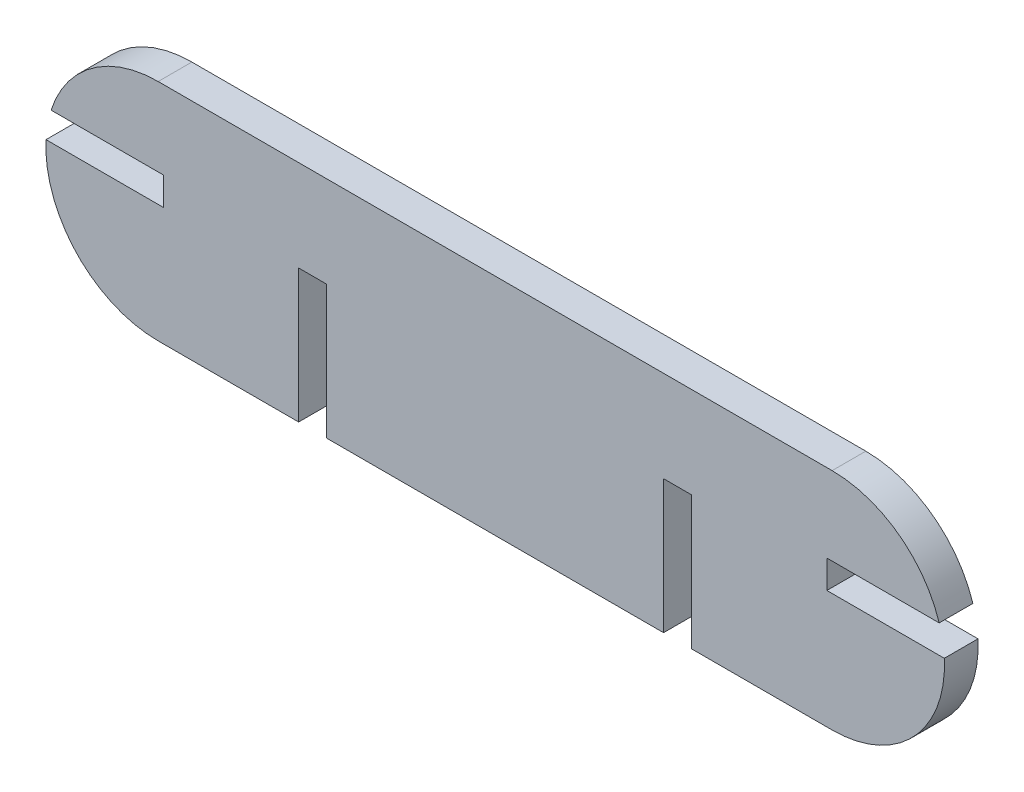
ISO-10303-21;
HEADER;
FILE_DESCRIPTION(('STEP AP214'),'2;1');
FILE_NAME('part.step','',(''),(''),'','','');
FILE_SCHEMA(('AUTOMOTIVE_DESIGN { 1 0 10303 214 1 1 1 1 }'));
ENDSEC;
DATA;
#1=APPLICATION_CONTEXT('core data for automotive mechanical design processes');
#2=APPLICATION_PROTOCOL_DEFINITION('international standard','automotive_design',2000,#1);
#3=PRODUCT_CONTEXT('',#1,'mechanical');
#4=PRODUCT('Part','Part','',(#3));
#5=PRODUCT_RELATED_PRODUCT_CATEGORY('part','',(#4));
#6=PRODUCT_DEFINITION_FORMATION('','',#4);
#7=PRODUCT_DEFINITION_CONTEXT('part definition',#1,'design');
#8=PRODUCT_DEFINITION('design','',#6,#7);
#9=PRODUCT_DEFINITION_SHAPE('','',#8);
#10=(LENGTH_UNIT() NAMED_UNIT(*) SI_UNIT(.MILLI.,.METRE.));
#11=(NAMED_UNIT(*) PLANE_ANGLE_UNIT() SI_UNIT($,.RADIAN.));
#12=(NAMED_UNIT(*) SI_UNIT($,.STERADIAN.) SOLID_ANGLE_UNIT());
#13=UNCERTAINTY_MEASURE_WITH_UNIT(LENGTH_MEASURE(1.E-05),#10,'distance_accuracy_value','');
#14=(GEOMETRIC_REPRESENTATION_CONTEXT(3) GLOBAL_UNCERTAINTY_ASSIGNED_CONTEXT((#13)) GLOBAL_UNIT_ASSIGNED_CONTEXT((#10,
#11,#12)) REPRESENTATION_CONTEXT('',''));
#15=CARTESIAN_POINT('',(0.,0.,0.));
#16=DIRECTION('',(0.,0.,1.));
#17=DIRECTION('',(1.,0.,0.));
#18=AXIS2_PLACEMENT_3D('',#15,#16,#17);
#19=CARTESIAN_POINT('',(30.0000000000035,-1.77500000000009,3.));
#20=DIRECTION('',(0.,0.,-1.));
#21=DIRECTION('',(-1.,0.,0.));
#22=AXIS2_PLACEMENT_3D('',#19,#20,#21);
#23=CYLINDRICAL_SURFACE('',#22,10.);
#24=CARTESIAN_POINT('',(30.0000000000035,-1.77500000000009,0.));
#25=DIRECTION('',(0.,0.,1.));
#26=DIRECTION('',(1.,0.,0.));
#27=AXIS2_PLACEMENT_3D('',#24,#25,#26);
#28=CIRCLE('',#27,10.);
#29=CARTESIAN_POINT('',(30.0000000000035,-11.7750000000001,0.));
#30=VERTEX_POINT('',#29);
#31=CARTESIAN_POINT('',(39.9862092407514,-1.25,0.));
#32=VERTEX_POINT('',#31);
#33=EDGE_CURVE('E201',#30,#32,#28,.T.);
#34=ORIENTED_EDGE('',*,*,#33,.T.);
#35=DIRECTION('',(0.,0.,-1.));
#36=VECTOR('',#35,1.);
#37=CARTESIAN_POINT('',(39.9862092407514,-1.25,3.));
#38=LINE('',#37,#36);
#39=CARTESIAN_POINT('',(39.9862092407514,-1.25,3.));
#40=VERTEX_POINT('',#39);
#41=EDGE_CURVE('E11',#40,#32,#38,.T.);
#42=ORIENTED_EDGE('',*,*,#41,.F.);
#43=CARTESIAN_POINT('',(30.0000000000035,-1.77500000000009,3.));
#44=DIRECTION('',(0.,0.,1.));
#45=DIRECTION('',(1.,0.,0.));
#46=AXIS2_PLACEMENT_3D('',#43,#44,#45);
#47=CIRCLE('',#46,10.);
#48=CARTESIAN_POINT('',(30.0000000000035,-11.7750000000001,3.));
#49=VERTEX_POINT('',#48);
#50=EDGE_CURVE('E239',#49,#40,#47,.T.);
#51=ORIENTED_EDGE('',*,*,#50,.F.);
#52=DIRECTION('',(0.,0.,-1.));
#53=VECTOR('',#52,1.);
#54=CARTESIAN_POINT('',(30.0000000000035,-11.7750000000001,3.));
#55=LINE('',#54,#53);
#56=EDGE_CURVE('E197',#49,#30,#55,.T.);
#57=ORIENTED_EDGE('',*,*,#56,.T.);
#58=EDGE_LOOP('',(#34,#42,#51,#57));
#59=FACE_BOUND('',#58,.T.);
#60=ADVANCED_FACE('F33',(#59),#23,.T.);
#61=CARTESIAN_POINT('',(39.9862092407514,-1.25,3.));
#62=DIRECTION('',(0.,-1.,0.));
#63=DIRECTION('',(0.,0.,-1.));
#64=AXIS2_PLACEMENT_3D('',#61,#62,#63);
#65=PLANE('',#64);
#66=DIRECTION('',(-1.,0.,0.));
#67=VECTOR('',#66,1.);
#68=CARTESIAN_POINT('',(39.9862092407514,-1.25,0.));
#69=LINE('',#68,#67);
#70=CARTESIAN_POINT('',(29.5314938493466,-1.25,0.));
#71=VERTEX_POINT('',#70);
#72=EDGE_CURVE('E204',#32,#71,#69,.T.);
#73=ORIENTED_EDGE('',*,*,#72,.T.);
#74=DIRECTION('',(0.,0.,-1.));
#75=VECTOR('',#74,1.);
#76=CARTESIAN_POINT('',(29.5314938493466,-1.25,3.));
#77=LINE('',#76,#75);
#78=CARTESIAN_POINT('',(29.5314938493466,-1.25,3.));
#79=VERTEX_POINT('',#78);
#80=EDGE_CURVE('E41',#79,#71,#77,.T.);
#81=ORIENTED_EDGE('',*,*,#80,.F.);
#82=DIRECTION('',(-1.,0.,0.));
#83=VECTOR('',#82,1.);
#84=CARTESIAN_POINT('',(39.9862092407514,-1.25,3.));
#85=LINE('',#84,#83);
#86=EDGE_CURVE('E128',#40,#79,#85,.T.);
#87=ORIENTED_EDGE('',*,*,#86,.F.);
#88=ORIENTED_EDGE('',*,*,#41,.T.);
#89=EDGE_LOOP('',(#73,#81,#87,#88));
#90=FACE_BOUND('',#89,.T.);
#91=ADVANCED_FACE('F357',(#90),#65,.F.);
#92=CARTESIAN_POINT('',(29.5314938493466,1.25,3.));
#93=DIRECTION('',(-1.,0.,0.));
#94=DIRECTION('',(0.,0.,1.));
#95=AXIS2_PLACEMENT_3D('',#92,#93,#94);
#96=PLANE('',#95);
#97=DIRECTION('',(0.,1.,0.));
#98=VECTOR('',#97,1.);
#99=CARTESIAN_POINT('',(29.5314938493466,1.25,0.));
#100=LINE('',#99,#98);
#101=CARTESIAN_POINT('',(29.5314938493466,1.25,0.));
#102=VERTEX_POINT('',#101);
#103=EDGE_CURVE('E206',#71,#102,#100,.T.);
#104=ORIENTED_EDGE('',*,*,#103,.T.);
#105=DIRECTION('',(0.,0.,-1.));
#106=VECTOR('',#105,1.);
#107=CARTESIAN_POINT('',(29.5314938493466,1.25,3.));
#108=LINE('',#107,#106);
#109=CARTESIAN_POINT('',(29.5314938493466,1.25,3.));
#110=VERTEX_POINT('',#109);
#111=EDGE_CURVE('E282',#110,#102,#108,.T.);
#112=ORIENTED_EDGE('',*,*,#111,.F.);
#113=DIRECTION('',(0.,1.,0.));
#114=VECTOR('',#113,1.);
#115=CARTESIAN_POINT('',(29.5314938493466,1.25,3.));
#116=LINE('',#115,#114);
#117=EDGE_CURVE('E290',#79,#110,#116,.T.);
#118=ORIENTED_EDGE('',*,*,#117,.F.);
#119=ORIENTED_EDGE('',*,*,#80,.T.);
#120=EDGE_LOOP('',(#104,#112,#118,#119));
#121=FACE_BOUND('',#120,.T.);
#122=ADVANCED_FACE('F288',(#121),#96,.F.);
#123=CARTESIAN_POINT('',(39.5314938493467,1.25,3.));
#124=DIRECTION('',(0.,1.,0.));
#125=DIRECTION('',(0.,0.,1.));
#126=AXIS2_PLACEMENT_3D('',#123,#124,#125);
#127=PLANE('',#126);
#128=DIRECTION('',(1.,0.,0.));
#129=VECTOR('',#128,1.);
#130=CARTESIAN_POINT('',(39.5314938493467,1.25,0.));
#131=LINE('',#130,#129);
#132=CARTESIAN_POINT('',(39.5314938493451,1.24999999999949,0.));
#133=VERTEX_POINT('',#132);
#134=EDGE_CURVE('E208',#102,#133,#131,.T.);
#135=ORIENTED_EDGE('',*,*,#134,.T.);
#136=DIRECTION('',(0.,0.,-1.));
#137=VECTOR('',#136,1.);
#138=CARTESIAN_POINT('',(39.5314938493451,1.24999999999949,3.));
#139=LINE('',#138,#137);
#140=CARTESIAN_POINT('',(39.5314938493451,1.24999999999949,3.));
#141=VERTEX_POINT('',#140);
#142=EDGE_CURVE('E279',#141,#133,#139,.T.);
#143=ORIENTED_EDGE('',*,*,#142,.F.);
#144=DIRECTION('',(1.,0.,0.));
#145=VECTOR('',#144,1.);
#146=CARTESIAN_POINT('',(39.5314938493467,1.25,3.));
#147=LINE('',#146,#145);
#148=EDGE_CURVE('E308',#110,#141,#147,.T.);
#149=ORIENTED_EDGE('',*,*,#148,.F.);
#150=ORIENTED_EDGE('',*,*,#111,.T.);
#151=EDGE_LOOP('',(#135,#143,#149,#150));
#152=FACE_BOUND('',#151,.T.);
#153=ADVANCED_FACE('F299',(#152),#127,.F.);
#154=CARTESIAN_POINT('',(30.0000000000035,-1.77500000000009,3.));
#155=DIRECTION('',(0.,0.,-1.));
#156=DIRECTION('',(-1.,0.,0.));
#157=AXIS2_PLACEMENT_3D('',#154,#155,#156);
#158=CYLINDRICAL_SURFACE('',#157,10.0000000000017);
#159=CARTESIAN_POINT('',(30.0000000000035,-1.77500000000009,0.));
#160=DIRECTION('',(0.,0.,1.));
#161=DIRECTION('',(1.,0.,0.));
#162=AXIS2_PLACEMENT_3D('',#159,#160,#161);
#163=CIRCLE('',#162,10.0000000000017);
#164=CARTESIAN_POINT('',(30.0000000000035,8.22499999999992,0.));
#165=VERTEX_POINT('',#164);
#166=EDGE_CURVE('E210',#133,#165,#163,.T.);
#167=ORIENTED_EDGE('',*,*,#166,.T.);
#168=DIRECTION('',(0.,0.,-1.));
#169=VECTOR('',#168,1.);
#170=CARTESIAN_POINT('',(30.0000000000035,8.22499999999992,3.));
#171=LINE('',#170,#169);
#172=CARTESIAN_POINT('',(30.0000000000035,8.22499999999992,3.));
#173=VERTEX_POINT('',#172);
#174=EDGE_CURVE('E276',#173,#165,#171,.T.);
#175=ORIENTED_EDGE('',*,*,#174,.F.);
#176=CARTESIAN_POINT('',(30.0000000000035,-1.77500000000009,3.));
#177=DIRECTION('',(0.,0.,1.));
#178=DIRECTION('',(1.,0.,0.));
#179=AXIS2_PLACEMENT_3D('',#176,#177,#178);
#180=CIRCLE('',#179,10.0000000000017);
#181=EDGE_CURVE('E305',#141,#173,#180,.T.);
#182=ORIENTED_EDGE('',*,*,#181,.F.);
#183=ORIENTED_EDGE('',*,*,#142,.T.);
#184=EDGE_LOOP('',(#167,#175,#182,#183));
#185=FACE_BOUND('',#184,.T.);
#186=ADVANCED_FACE('F303',(#185),#158,.T.);
#187=CARTESIAN_POINT('',(-29.9999999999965,8.22499999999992,3.));
#188=DIRECTION('',(0.,-1.,0.));
#189=DIRECTION('',(0.,0.,-1.));
#190=AXIS2_PLACEMENT_3D('',#187,#188,#189);
#191=PLANE('',#190);
#192=DIRECTION('',(-1.,0.,0.));
#193=VECTOR('',#192,1.);
#194=CARTESIAN_POINT('',(-29.9999999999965,8.22499999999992,0.));
#195=LINE('',#194,#193);
#196=CARTESIAN_POINT('',(-29.9999999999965,8.22500000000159,0.));
#197=VERTEX_POINT('',#196);
#198=EDGE_CURVE('E212',#165,#197,#195,.T.);
#199=ORIENTED_EDGE('',*,*,#198,.T.);
#200=DIRECTION('',(0.,0.,-1.));
#201=VECTOR('',#200,1.);
#202=CARTESIAN_POINT('',(-29.9999999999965,8.22500000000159,3.));
#203=LINE('',#202,#201);
#204=CARTESIAN_POINT('',(-29.9999999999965,8.22500000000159,3.));
#205=VERTEX_POINT('',#204);
#206=EDGE_CURVE('E273',#205,#197,#203,.T.);
#207=ORIENTED_EDGE('',*,*,#206,.F.);
#208=DIRECTION('',(-1.,0.,0.));
#209=VECTOR('',#208,1.);
#210=CARTESIAN_POINT('',(-29.9999999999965,8.22499999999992,3.));
#211=LINE('',#210,#209);
#212=EDGE_CURVE('E307',#173,#205,#211,.T.);
#213=ORIENTED_EDGE('',*,*,#212,.F.);
#214=ORIENTED_EDGE('',*,*,#174,.T.);
#215=EDGE_LOOP('',(#199,#207,#213,#214));
#216=FACE_BOUND('',#215,.T.);
#217=ADVANCED_FACE('F370',(#216),#191,.F.);
#218=CARTESIAN_POINT('',(-29.9999999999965,-1.77500000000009,3.));
#219=DIRECTION('',(0.,0.,-1.));
#220=DIRECTION('',(-1.,0.,0.));
#221=AXIS2_PLACEMENT_3D('',#218,#219,#220);
#222=CYLINDRICAL_SURFACE('',#221,10.0000000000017);
#223=CARTESIAN_POINT('',(-29.9999999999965,-1.77500000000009,0.));
#224=DIRECTION('',(0.,0.,1.));
#225=DIRECTION('',(1.,0.,0.));
#226=AXIS2_PLACEMENT_3D('',#223,#224,#225);
#227=CIRCLE('',#226,10.0000000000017);
#228=CARTESIAN_POINT('',(-39.5314938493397,1.25,0.));
#229=VERTEX_POINT('',#228);
#230=EDGE_CURVE('E214',#197,#229,#227,.T.);
#231=ORIENTED_EDGE('',*,*,#230,.T.);
#232=DIRECTION('',(0.,0.,-1.));
#233=VECTOR('',#232,1.);
#234=CARTESIAN_POINT('',(-39.5314938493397,1.25,3.));
#235=LINE('',#234,#233);
#236=CARTESIAN_POINT('',(-39.5314938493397,1.25,3.));
#237=VERTEX_POINT('',#236);
#238=EDGE_CURVE('E270',#237,#229,#235,.T.);
#239=ORIENTED_EDGE('',*,*,#238,.F.);
#240=CARTESIAN_POINT('',(-29.9999999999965,-1.77500000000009,3.));
#241=DIRECTION('',(0.,0.,1.));
#242=DIRECTION('',(1.,0.,0.));
#243=AXIS2_PLACEMENT_3D('',#240,#241,#242);
#244=CIRCLE('',#243,10.0000000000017);
#245=EDGE_CURVE('E310',#205,#237,#244,.T.);
#246=ORIENTED_EDGE('',*,*,#245,.F.);
#247=ORIENTED_EDGE('',*,*,#206,.T.);
#248=EDGE_LOOP('',(#231,#239,#246,#247));
#249=FACE_BOUND('',#248,.T.);
#250=ADVANCED_FACE('F373',(#249),#222,.T.);
#251=CARTESIAN_POINT('',(-39.5314938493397,1.25,3.));
#252=DIRECTION('',(0.,1.,0.));
#253=DIRECTION('',(0.,0.,1.));
#254=AXIS2_PLACEMENT_3D('',#251,#252,#253);
#255=PLANE('',#254);
#256=DIRECTION('',(1.,0.,0.));
#257=VECTOR('',#256,1.);
#258=CARTESIAN_POINT('',(-39.5314938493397,1.25,0.));
#259=LINE('',#258,#257);
#260=CARTESIAN_POINT('',(-29.5314938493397,1.25,0.));
#261=VERTEX_POINT('',#260);
#262=EDGE_CURVE('E216',#229,#261,#259,.T.);
#263=ORIENTED_EDGE('',*,*,#262,.T.);
#264=DIRECTION('',(0.,0.,-1.));
#265=VECTOR('',#264,1.);
#266=CARTESIAN_POINT('',(-29.5314938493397,1.25,3.));
#267=LINE('',#266,#265);
#268=CARTESIAN_POINT('',(-29.5314938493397,1.25,3.));
#269=VERTEX_POINT('',#268);
#270=EDGE_CURVE('E267',#269,#261,#267,.T.);
#271=ORIENTED_EDGE('',*,*,#270,.F.);
#272=DIRECTION('',(1.,0.,0.));
#273=VECTOR('',#272,1.);
#274=CARTESIAN_POINT('',(-39.5314938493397,1.25,3.));
#275=LINE('',#274,#273);
#276=EDGE_CURVE('E316',#237,#269,#275,.T.);
#277=ORIENTED_EDGE('',*,*,#276,.F.);
#278=ORIENTED_EDGE('',*,*,#238,.T.);
#279=EDGE_LOOP('',(#263,#271,#277,#278));
#280=FACE_BOUND('',#279,.T.);
#281=ADVANCED_FACE('F377',(#280),#255,.F.);
#282=CARTESIAN_POINT('',(-29.5314938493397,1.25,3.));
#283=DIRECTION('',(1.,0.,0.));
#284=DIRECTION('',(0.,0.,-1.));
#285=AXIS2_PLACEMENT_3D('',#282,#283,#284);
#286=PLANE('',#285);
#287=DIRECTION('',(0.,-1.,0.));
#288=VECTOR('',#287,1.);
#289=CARTESIAN_POINT('',(-29.5314938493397,1.25,0.));
#290=LINE('',#289,#288);
#291=CARTESIAN_POINT('',(-29.5314938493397,-1.25,0.));
#292=VERTEX_POINT('',#291);
#293=EDGE_CURVE('E218',#261,#292,#290,.T.);
#294=ORIENTED_EDGE('',*,*,#293,.T.);
#295=DIRECTION('',(0.,0.,-1.));
#296=VECTOR('',#295,1.);
#297=CARTESIAN_POINT('',(-29.5314938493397,-1.25,3.));
#298=LINE('',#297,#296);
#299=CARTESIAN_POINT('',(-29.5314938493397,-1.25,3.));
#300=VERTEX_POINT('',#299);
#301=EDGE_CURVE('E264',#300,#292,#298,.T.);
#302=ORIENTED_EDGE('',*,*,#301,.F.);
#303=DIRECTION('',(0.,-1.,0.));
#304=VECTOR('',#303,1.);
#305=CARTESIAN_POINT('',(-29.5314938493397,1.25,3.));
#306=LINE('',#305,#304);
#307=EDGE_CURVE('E318',#269,#300,#306,.T.);
#308=ORIENTED_EDGE('',*,*,#307,.F.);
#309=ORIENTED_EDGE('',*,*,#270,.T.);
#310=EDGE_LOOP('',(#294,#302,#308,#309));
#311=FACE_BOUND('',#310,.T.);
#312=ADVANCED_FACE('F381',(#311),#286,.F.);
#313=CARTESIAN_POINT('',(-39.9862092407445,-1.25,3.));
#314=DIRECTION('',(0.,-1.,0.));
#315=DIRECTION('',(0.,0.,-1.));
#316=AXIS2_PLACEMENT_3D('',#313,#314,#315);
#317=PLANE('',#316);
#318=DIRECTION('',(-1.,0.,0.));
#319=VECTOR('',#318,1.);
#320=CARTESIAN_POINT('',(-39.9862092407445,-1.25,0.));
#321=LINE('',#320,#319);
#322=CARTESIAN_POINT('',(-39.9862092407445,-1.25,0.));
#323=VERTEX_POINT('',#322);
#324=EDGE_CURVE('E220',#292,#323,#321,.T.);
#325=ORIENTED_EDGE('',*,*,#324,.T.);
#326=DIRECTION('',(0.,0.,-1.));
#327=VECTOR('',#326,1.);
#328=CARTESIAN_POINT('',(-39.9862092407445,-1.25,3.));
#329=LINE('',#328,#327);
#330=CARTESIAN_POINT('',(-39.9862092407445,-1.25,3.));
#331=VERTEX_POINT('',#330);
#332=EDGE_CURVE('E261',#331,#323,#329,.T.);
#333=ORIENTED_EDGE('',*,*,#332,.F.);
#334=DIRECTION('',(-1.,0.,0.));
#335=VECTOR('',#334,1.);
#336=CARTESIAN_POINT('',(-39.9862092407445,-1.25,3.));
#337=LINE('',#336,#335);
#338=EDGE_CURVE('E320',#300,#331,#337,.T.);
#339=ORIENTED_EDGE('',*,*,#338,.F.);
#340=ORIENTED_EDGE('',*,*,#301,.T.);
#341=EDGE_LOOP('',(#325,#333,#339,#340));
#342=FACE_BOUND('',#341,.T.);
#343=ADVANCED_FACE('F385',(#342),#317,.F.);
#344=CARTESIAN_POINT('',(-29.9999999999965,-1.77500000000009,3.));
#345=DIRECTION('',(0.,0.,-1.));
#346=DIRECTION('',(-1.,0.,0.));
#347=AXIS2_PLACEMENT_3D('',#344,#345,#346);
#348=CYLINDRICAL_SURFACE('',#347,10.);
#349=CARTESIAN_POINT('',(-29.9999999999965,-1.77500000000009,0.));
#350=DIRECTION('',(0.,0.,1.));
#351=DIRECTION('',(1.,0.,0.));
#352=AXIS2_PLACEMENT_3D('',#349,#350,#351);
#353=CIRCLE('',#352,10.);
#354=CARTESIAN_POINT('',(-29.9999999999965,-11.7750000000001,0.));
#355=VERTEX_POINT('',#354);
#356=EDGE_CURVE('E222',#323,#355,#353,.T.);
#357=ORIENTED_EDGE('',*,*,#356,.T.);
#358=DIRECTION('',(0.,0.,-1.));
#359=VECTOR('',#358,1.);
#360=CARTESIAN_POINT('',(-29.9999999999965,-11.7750000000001,3.));
#361=LINE('',#360,#359);
#362=CARTESIAN_POINT('',(-29.9999999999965,-11.7750000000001,3.));
#363=VERTEX_POINT('',#362);
#364=EDGE_CURVE('E258',#363,#355,#361,.T.);
#365=ORIENTED_EDGE('',*,*,#364,.F.);
#366=CARTESIAN_POINT('',(-29.9999999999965,-1.77500000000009,3.));
#367=DIRECTION('',(0.,0.,1.));
#368=DIRECTION('',(1.,0.,0.));
#369=AXIS2_PLACEMENT_3D('',#366,#367,#368);
#370=CIRCLE('',#369,10.);
#371=EDGE_CURVE('E322',#331,#363,#370,.T.);
#372=ORIENTED_EDGE('',*,*,#371,.F.);
#373=ORIENTED_EDGE('',*,*,#332,.T.);
#374=EDGE_LOOP('',(#357,#365,#372,#373));
#375=FACE_BOUND('',#374,.T.);
#376=ADVANCED_FACE('F389',(#375),#348,.T.);
#377=CARTESIAN_POINT('',(-29.9999999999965,-11.7750000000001,3.));
#378=DIRECTION('',(0.,1.,0.));
#379=DIRECTION('',(0.,0.,1.));
#380=AXIS2_PLACEMENT_3D('',#377,#378,#379);
#381=PLANE('',#380);
#382=DIRECTION('',(1.,0.,0.));
#383=VECTOR('',#382,1.);
#384=CARTESIAN_POINT('',(-29.9999999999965,-11.7750000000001,0.));
#385=LINE('',#384,#383);
#386=CARTESIAN_POINT('',(-17.4936420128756,-11.7750000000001,0.));
#387=VERTEX_POINT('',#386);
#388=EDGE_CURVE('E224',#355,#387,#385,.T.);
#389=ORIENTED_EDGE('',*,*,#388,.T.);
#390=DIRECTION('',(0.,0.,-1.));
#391=VECTOR('',#390,1.);
#392=CARTESIAN_POINT('',(-17.4936420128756,-11.7750000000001,3.));
#393=LINE('',#392,#391);
#394=CARTESIAN_POINT('',(-17.4936420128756,-11.7750000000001,3.));
#395=VERTEX_POINT('',#394);
#396=EDGE_CURVE('E255',#395,#387,#393,.T.);
#397=ORIENTED_EDGE('',*,*,#396,.F.);
#398=DIRECTION('',(1.,0.,0.));
#399=VECTOR('',#398,1.);
#400=CARTESIAN_POINT('',(-29.9999999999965,-11.7750000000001,3.));
#401=LINE('',#400,#399);
#402=EDGE_CURVE('E324',#363,#395,#401,.T.);
#403=ORIENTED_EDGE('',*,*,#402,.F.);
#404=ORIENTED_EDGE('',*,*,#364,.T.);
#405=EDGE_LOOP('',(#389,#397,#403,#404));
#406=FACE_BOUND('',#405,.T.);
#407=ADVANCED_FACE('F393',(#406),#381,.F.);
#408=CARTESIAN_POINT('',(-17.4936420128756,0.099999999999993,3.));
#409=DIRECTION('',(-1.,0.,0.));
#410=DIRECTION('',(0.,0.,1.));
#411=AXIS2_PLACEMENT_3D('',#408,#409,#410);
#412=PLANE('',#411);
#413=DIRECTION('',(0.,1.,0.));
#414=VECTOR('',#413,1.);
#415=CARTESIAN_POINT('',(-17.4936420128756,0.099999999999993,0.));
#416=LINE('',#415,#414);
#417=CARTESIAN_POINT('',(-17.4936420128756,0.099999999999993,0.));
#418=VERTEX_POINT('',#417);
#419=EDGE_CURVE('E226',#387,#418,#416,.T.);
#420=ORIENTED_EDGE('',*,*,#419,.T.);
#421=DIRECTION('',(0.,0.,-1.));
#422=VECTOR('',#421,1.);
#423=CARTESIAN_POINT('',(-17.4936420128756,0.099999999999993,3.));
#424=LINE('',#423,#422);
#425=CARTESIAN_POINT('',(-17.4936420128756,0.099999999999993,3.));
#426=VERTEX_POINT('',#425);
#427=EDGE_CURVE('E252',#426,#418,#424,.T.);
#428=ORIENTED_EDGE('',*,*,#427,.F.);
#429=DIRECTION('',(0.,1.,0.));
#430=VECTOR('',#429,1.);
#431=CARTESIAN_POINT('',(-17.4936420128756,0.099999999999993,3.));
#432=LINE('',#431,#430);
#433=EDGE_CURVE('E326',#395,#426,#432,.T.);
#434=ORIENTED_EDGE('',*,*,#433,.F.);
#435=ORIENTED_EDGE('',*,*,#396,.T.);
#436=EDGE_LOOP('',(#420,#428,#434,#435));
#437=FACE_BOUND('',#436,.T.);
#438=ADVANCED_FACE('F397',(#437),#412,.F.);
#439=CARTESIAN_POINT('',(-14.9936420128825,0.0999999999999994,3.));
#440=DIRECTION('',(0.,1.,0.));
#441=DIRECTION('',(-1.,0.,0.));
#442=AXIS2_PLACEMENT_3D('',#439,#440,#441);
#443=PLANE('',#442);
#444=DIRECTION('',(1.,0.,0.));
#445=VECTOR('',#444,1.);
#446=CARTESIAN_POINT('',(-14.9936420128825,0.0999999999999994,0.));
#447=LINE('',#446,#445);
#448=CARTESIAN_POINT('',(-14.9936420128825,0.0999999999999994,0.));
#449=VERTEX_POINT('',#448);
#450=EDGE_CURVE('E228',#418,#449,#447,.T.);
#451=ORIENTED_EDGE('',*,*,#450,.T.);
#452=DIRECTION('',(0.,0.,-1.));
#453=VECTOR('',#452,1.);
#454=CARTESIAN_POINT('',(-14.9936420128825,0.0999999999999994,3.));
#455=LINE('',#454,#453);
#456=CARTESIAN_POINT('',(-14.9936420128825,0.0999999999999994,3.));
#457=VERTEX_POINT('',#456);
#458=EDGE_CURVE('E249',#457,#449,#455,.T.);
#459=ORIENTED_EDGE('',*,*,#458,.F.);
#460=DIRECTION('',(1.,0.,0.));
#461=VECTOR('',#460,1.);
#462=CARTESIAN_POINT('',(-14.9936420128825,0.0999999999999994,3.));
#463=LINE('',#462,#461);
#464=EDGE_CURVE('E328',#426,#457,#463,.T.);
#465=ORIENTED_EDGE('',*,*,#464,.F.);
#466=ORIENTED_EDGE('',*,*,#427,.T.);
#467=EDGE_LOOP('',(#451,#459,#465,#466));
#468=FACE_BOUND('',#467,.T.);
#469=ADVANCED_FACE('F401',(#468),#443,.F.);
#470=CARTESIAN_POINT('',(-14.9936420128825,0.0999999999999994,3.));
#471=DIRECTION('',(1.,5.88272121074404E-13,0.));
#472=DIRECTION('',(-5.88272121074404E-13,1.,0.));
#473=AXIS2_PLACEMENT_3D('',#470,#471,#472);
#474=PLANE('',#473);
#475=DIRECTION('',(5.88272121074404E-13,-1.,0.));
#476=VECTOR('',#475,1.);
#477=CARTESIAN_POINT('',(-14.9936420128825,0.0999999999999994,0.));
#478=LINE('',#477,#476);
#479=CARTESIAN_POINT('',(-14.9936420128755,-11.7750000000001,0.));
#480=VERTEX_POINT('',#479);
#481=EDGE_CURVE('E230',#449,#480,#478,.T.);
#482=ORIENTED_EDGE('',*,*,#481,.T.);
#483=DIRECTION('',(0.,0.,-1.));
#484=VECTOR('',#483,1.);
#485=CARTESIAN_POINT('',(-14.9936420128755,-11.7750000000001,3.));
#486=LINE('',#485,#484);
#487=CARTESIAN_POINT('',(-14.9936420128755,-11.7750000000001,3.));
#488=VERTEX_POINT('',#487);
#489=EDGE_CURVE('E246',#488,#480,#486,.T.);
#490=ORIENTED_EDGE('',*,*,#489,.F.);
#491=DIRECTION('',(5.88272121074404E-13,-1.,0.));
#492=VECTOR('',#491,1.);
#493=CARTESIAN_POINT('',(-14.9936420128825,0.0999999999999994,3.));
#494=LINE('',#493,#492);
#495=EDGE_CURVE('E330',#457,#488,#494,.T.);
#496=ORIENTED_EDGE('',*,*,#495,.F.);
#497=ORIENTED_EDGE('',*,*,#458,.T.);
#498=EDGE_LOOP('',(#482,#490,#496,#497));
#499=FACE_BOUND('',#498,.T.);
#500=ADVANCED_FACE('F405',(#499),#474,.F.);
#501=CARTESIAN_POINT('',(-14.9936420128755,-11.7750000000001,3.));
#502=DIRECTION('',(0.,1.,0.));
#503=DIRECTION('',(0.,0.,1.));
#504=AXIS2_PLACEMENT_3D('',#501,#502,#503);
#505=PLANE('',#504);
#506=DIRECTION('',(1.,0.,0.));
#507=VECTOR('',#506,1.);
#508=CARTESIAN_POINT('',(-14.9936420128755,-11.7750000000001,0.));
#509=LINE('',#508,#507);
#510=CARTESIAN_POINT('',(14.9936420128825,-11.7750000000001,0.));
#511=VERTEX_POINT('',#510);
#512=EDGE_CURVE('E232',#480,#511,#509,.T.);
#513=ORIENTED_EDGE('',*,*,#512,.T.);
#514=DIRECTION('',(0.,0.,-1.));
#515=VECTOR('',#514,1.);
#516=CARTESIAN_POINT('',(14.9936420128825,-11.7750000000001,3.));
#517=LINE('',#516,#515);
#518=CARTESIAN_POINT('',(14.9936420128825,-11.7750000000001,3.));
#519=VERTEX_POINT('',#518);
#520=EDGE_CURVE('E243',#519,#511,#517,.T.);
#521=ORIENTED_EDGE('',*,*,#520,.F.);
#522=DIRECTION('',(1.,0.,0.));
#523=VECTOR('',#522,1.);
#524=CARTESIAN_POINT('',(-14.9936420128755,-11.7750000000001,3.));
#525=LINE('',#524,#523);
#526=EDGE_CURVE('E332',#488,#519,#525,.T.);
#527=ORIENTED_EDGE('',*,*,#526,.F.);
#528=ORIENTED_EDGE('',*,*,#489,.T.);
#529=EDGE_LOOP('',(#513,#521,#527,#528));
#530=FACE_BOUND('',#529,.T.);
#531=ADVANCED_FACE('F338',(#530),#505,.F.);
#532=CARTESIAN_POINT('',(14.9936420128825,0.0999999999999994,3.));
#533=DIRECTION('',(-1.,0.,0.));
#534=DIRECTION('',(0.,-1.,0.));
#535=AXIS2_PLACEMENT_3D('',#532,#533,#534);
#536=PLANE('',#535);
#537=DIRECTION('',(0.,1.,0.));
#538=VECTOR('',#537,1.);
#539=CARTESIAN_POINT('',(14.9936420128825,0.0999999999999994,0.));
#540=LINE('',#539,#538);
#541=CARTESIAN_POINT('',(14.9936420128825,0.0999999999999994,0.));
#542=VERTEX_POINT('',#541);
#543=EDGE_CURVE('E234',#511,#542,#540,.T.);
#544=ORIENTED_EDGE('',*,*,#543,.T.);
#545=DIRECTION('',(0.,0.,-1.));
#546=VECTOR('',#545,1.);
#547=CARTESIAN_POINT('',(14.9936420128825,0.0999999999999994,3.));
#548=LINE('',#547,#546);
#549=CARTESIAN_POINT('',(14.9936420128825,0.0999999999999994,3.));
#550=VERTEX_POINT('',#549);
#551=EDGE_CURVE('E192',#550,#542,#548,.T.);
#552=ORIENTED_EDGE('',*,*,#551,.F.);
#553=DIRECTION('',(0.,1.,0.));
#554=VECTOR('',#553,1.);
#555=CARTESIAN_POINT('',(14.9936420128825,0.0999999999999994,3.));
#556=LINE('',#555,#554);
#557=EDGE_CURVE('E183',#519,#550,#556,.T.);
#558=ORIENTED_EDGE('',*,*,#557,.F.);
#559=ORIENTED_EDGE('',*,*,#520,.T.);
#560=EDGE_LOOP('',(#544,#552,#558,#559));
#561=FACE_BOUND('',#560,.T.);
#562=ADVANCED_FACE('F342',(#561),#536,.F.);
#563=CARTESIAN_POINT('',(14.9936420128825,0.0999999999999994,3.));
#564=DIRECTION('',(0.,1.,0.));
#565=DIRECTION('',(0.,0.,1.));
#566=AXIS2_PLACEMENT_3D('',#563,#564,#565);
#567=PLANE('',#566);
#568=DIRECTION('',(1.,0.,0.));
#569=VECTOR('',#568,1.);
#570=CARTESIAN_POINT('',(14.9936420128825,0.0999999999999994,0.));
#571=LINE('',#570,#569);
#572=CARTESIAN_POINT('',(17.4936420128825,0.0999999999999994,0.));
#573=VERTEX_POINT('',#572);
#574=EDGE_CURVE('E191',#542,#573,#571,.T.);
#575=ORIENTED_EDGE('',*,*,#574,.T.);
#576=DIRECTION('',(0.,0.,-1.));
#577=VECTOR('',#576,1.);
#578=CARTESIAN_POINT('',(17.4936420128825,0.0999999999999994,3.));
#579=LINE('',#578,#577);
#580=CARTESIAN_POINT('',(17.4936420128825,0.0999999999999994,3.));
#581=VERTEX_POINT('',#580);
#582=EDGE_CURVE('E188',#581,#573,#579,.T.);
#583=ORIENTED_EDGE('',*,*,#582,.F.);
#584=DIRECTION('',(1.,0.,0.));
#585=VECTOR('',#584,1.);
#586=CARTESIAN_POINT('',(14.9936420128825,0.0999999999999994,3.));
#587=LINE('',#586,#585);
#588=EDGE_CURVE('E177',#550,#581,#587,.T.);
#589=ORIENTED_EDGE('',*,*,#588,.F.);
#590=ORIENTED_EDGE('',*,*,#551,.T.);
#591=EDGE_LOOP('',(#575,#583,#589,#590));
#592=FACE_BOUND('',#591,.T.);
#593=ADVANCED_FACE('F189',(#592),#567,.F.);
#594=CARTESIAN_POINT('',(17.4936420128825,0.0999999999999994,3.));
#595=DIRECTION('',(1.,0.,0.));
#596=DIRECTION('',(0.,0.,-1.));
#597=AXIS2_PLACEMENT_3D('',#594,#595,#596);
#598=PLANE('',#597);
#599=DIRECTION('',(0.,-1.,0.));
#600=VECTOR('',#599,1.);
#601=CARTESIAN_POINT('',(17.4936420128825,0.0999999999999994,0.));
#602=LINE('',#601,#600);
#603=CARTESIAN_POINT('',(17.4936420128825,-11.7750000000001,0.));
#604=VERTEX_POINT('',#603);
#605=EDGE_CURVE('E114',#573,#604,#602,.T.);
#606=ORIENTED_EDGE('',*,*,#605,.T.);
#607=DIRECTION('',(0.,0.,-1.));
#608=VECTOR('',#607,1.);
#609=CARTESIAN_POINT('',(17.4936420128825,-11.7750000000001,3.));
#610=LINE('',#609,#608);
#611=CARTESIAN_POINT('',(17.4936420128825,-11.7750000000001,3.));
#612=VERTEX_POINT('',#611);
#613=EDGE_CURVE('E193',#612,#604,#610,.T.);
#614=ORIENTED_EDGE('',*,*,#613,.F.);
#615=DIRECTION('',(0.,-1.,0.));
#616=VECTOR('',#615,1.);
#617=CARTESIAN_POINT('',(17.4936420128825,0.0999999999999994,3.));
#618=LINE('',#617,#616);
#619=EDGE_CURVE('E181',#581,#612,#618,.T.);
#620=ORIENTED_EDGE('',*,*,#619,.F.);
#621=ORIENTED_EDGE('',*,*,#582,.T.);
#622=EDGE_LOOP('',(#606,#614,#620,#621));
#623=FACE_BOUND('',#622,.T.);
#624=ADVANCED_FACE('F195',(#623),#598,.F.);
#625=CARTESIAN_POINT('',(17.4936420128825,-11.7750000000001,3.));
#626=DIRECTION('',(0.,1.,0.));
#627=DIRECTION('',(0.,0.,1.));
#628=AXIS2_PLACEMENT_3D('',#625,#626,#627);
#629=PLANE('',#628);
#630=DIRECTION('',(1.,0.,0.));
#631=VECTOR('',#630,1.);
#632=CARTESIAN_POINT('',(17.4936420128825,-11.7750000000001,0.));
#633=LINE('',#632,#631);
#634=EDGE_CURVE('E120',#604,#30,#633,.T.);
#635=ORIENTED_EDGE('',*,*,#634,.T.);
#636=ORIENTED_EDGE('',*,*,#56,.F.);
#637=DIRECTION('',(1.,0.,0.));
#638=VECTOR('',#637,1.);
#639=CARTESIAN_POINT('',(17.4936420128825,-11.7750000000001,3.));
#640=LINE('',#639,#638);
#641=EDGE_CURVE('E49',#612,#49,#640,.T.);
#642=ORIENTED_EDGE('',*,*,#641,.F.);
#643=ORIENTED_EDGE('',*,*,#613,.T.);
#644=EDGE_LOOP('',(#635,#636,#642,#643));
#645=FACE_BOUND('',#644,.T.);
#646=ADVANCED_FACE('F346',(#645),#629,.F.);
#647=CARTESIAN_POINT('',(30.0000000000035,-1.77500000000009,3.));
#648=DIRECTION('',(0.,0.,1.));
#649=DIRECTION('',(1.,0.,0.));
#650=AXIS2_PLACEMENT_3D('',#647,#648,#649);
#651=PLANE('',#650);
#652=ORIENTED_EDGE('',*,*,#50,.T.);
#653=ORIENTED_EDGE('',*,*,#86,.T.);
#654=ORIENTED_EDGE('',*,*,#117,.T.);
#655=ORIENTED_EDGE('',*,*,#148,.T.);
#656=ORIENTED_EDGE('',*,*,#181,.T.);
#657=ORIENTED_EDGE('',*,*,#212,.T.);
#658=ORIENTED_EDGE('',*,*,#245,.T.);
#659=ORIENTED_EDGE('',*,*,#276,.T.);
#660=ORIENTED_EDGE('',*,*,#307,.T.);
#661=ORIENTED_EDGE('',*,*,#338,.T.);
#662=ORIENTED_EDGE('',*,*,#371,.T.);
#663=ORIENTED_EDGE('',*,*,#402,.T.);
#664=ORIENTED_EDGE('',*,*,#433,.T.);
#665=ORIENTED_EDGE('',*,*,#464,.T.);
#666=ORIENTED_EDGE('',*,*,#495,.T.);
#667=ORIENTED_EDGE('',*,*,#526,.T.);
#668=ORIENTED_EDGE('',*,*,#557,.T.);
#669=ORIENTED_EDGE('',*,*,#588,.T.);
#670=ORIENTED_EDGE('',*,*,#619,.T.);
#671=ORIENTED_EDGE('',*,*,#641,.T.);
#672=EDGE_LOOP('',(#652,#653,#654,#655,#656,#657,#658,#659,#660,#661,#662,#663,#664,#665,#666,
#667,#668,#669,#670,#671));
#673=FACE_BOUND('',#672,.T.);
#674=ADVANCED_FACE('F179',(#673),#651,.T.);
#675=CARTESIAN_POINT('',(30.0000000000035,-1.77500000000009,0.));
#676=DIRECTION('',(0.,0.,1.));
#677=DIRECTION('',(1.,0.,0.));
#678=AXIS2_PLACEMENT_3D('',#675,#676,#677);
#679=PLANE('',#678);
#680=ORIENTED_EDGE('',*,*,#33,.F.);
#681=ORIENTED_EDGE('',*,*,#634,.F.);
#682=ORIENTED_EDGE('',*,*,#605,.F.);
#683=ORIENTED_EDGE('',*,*,#574,.F.);
#684=ORIENTED_EDGE('',*,*,#543,.F.);
#685=ORIENTED_EDGE('',*,*,#512,.F.);
#686=ORIENTED_EDGE('',*,*,#481,.F.);
#687=ORIENTED_EDGE('',*,*,#450,.F.);
#688=ORIENTED_EDGE('',*,*,#419,.F.);
#689=ORIENTED_EDGE('',*,*,#388,.F.);
#690=ORIENTED_EDGE('',*,*,#356,.F.);
#691=ORIENTED_EDGE('',*,*,#324,.F.);
#692=ORIENTED_EDGE('',*,*,#293,.F.);
#693=ORIENTED_EDGE('',*,*,#262,.F.);
#694=ORIENTED_EDGE('',*,*,#230,.F.);
#695=ORIENTED_EDGE('',*,*,#198,.F.);
#696=ORIENTED_EDGE('',*,*,#166,.F.);
#697=ORIENTED_EDGE('',*,*,#134,.F.);
#698=ORIENTED_EDGE('',*,*,#103,.F.);
#699=ORIENTED_EDGE('',*,*,#72,.F.);
#700=EDGE_LOOP('',(#680,#681,#682,#683,#684,#685,#686,#687,#688,#689,#690,#691,#692,#693,#694,
#695,#696,#697,#698,#699));
#701=FACE_BOUND('',#700,.T.);
#702=ADVANCED_FACE('F294',(#701),#679,.F.);
#703=CLOSED_SHELL('',(#60,#91,#122,#153,#186,#217,#250,#281,#312,#343,#376,#407,#438,#469,#500,
#531,#562,#593,#624,#646,#674,#702));
#704=MANIFOLD_SOLID_BREP('B2',#703);
#705=ADVANCED_BREP_SHAPE_REPRESENTATION('',(#18,#704),#14);
#706=SHAPE_DEFINITION_REPRESENTATION(#9,#705);
ENDSEC;
END-ISO-10303-21;
